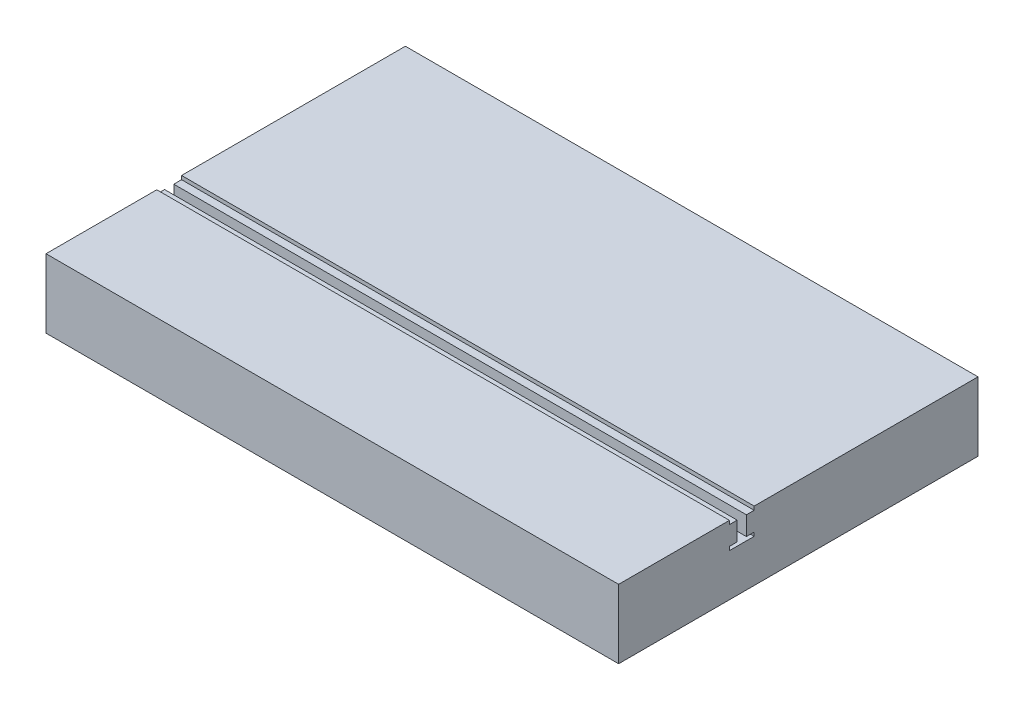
ISO-10303-21;
HEADER;
FILE_DESCRIPTION(('STEP AP214'),'2;1');
FILE_NAME('part.step','',(''),(''),'','','');
FILE_SCHEMA(('AUTOMOTIVE_DESIGN { 1 0 10303 214 1 1 1 1 }'));
ENDSEC;
DATA;
#1=APPLICATION_CONTEXT('core data for automotive mechanical design processes');
#2=APPLICATION_PROTOCOL_DEFINITION('international standard','automotive_design',2000,#1);
#3=PRODUCT_CONTEXT('',#1,'mechanical');
#4=PRODUCT('Part','Part','',(#3));
#5=PRODUCT_RELATED_PRODUCT_CATEGORY('part','',(#4));
#6=PRODUCT_DEFINITION_FORMATION('','',#4);
#7=PRODUCT_DEFINITION_CONTEXT('part definition',#1,'design');
#8=PRODUCT_DEFINITION('design','',#6,#7);
#9=PRODUCT_DEFINITION_SHAPE('','',#8);
#10=(LENGTH_UNIT() NAMED_UNIT(*) SI_UNIT(.MILLI.,.METRE.));
#11=(NAMED_UNIT(*) PLANE_ANGLE_UNIT() SI_UNIT($,.RADIAN.));
#12=(NAMED_UNIT(*) SI_UNIT($,.STERADIAN.) SOLID_ANGLE_UNIT());
#13=UNCERTAINTY_MEASURE_WITH_UNIT(LENGTH_MEASURE(1.E-05),#10,'distance_accuracy_value','');
#14=(GEOMETRIC_REPRESENTATION_CONTEXT(3) GLOBAL_UNCERTAINTY_ASSIGNED_CONTEXT((#13)) GLOBAL_UNIT_ASSIGNED_CONTEXT((#10,
#11,#12)) REPRESENTATION_CONTEXT('',''));
#15=CARTESIAN_POINT('',(0.,0.,0.));
#16=DIRECTION('',(0.,0.,1.));
#17=DIRECTION('',(1.,0.,0.));
#18=AXIS2_PLACEMENT_3D('',#15,#16,#17);
#19=CARTESIAN_POINT('',(-99.8579162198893,24.,62.6713484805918));
#20=DIRECTION('',(0.,1.,0.));
#21=DIRECTION('',(0.,0.,1.));
#22=AXIS2_PLACEMENT_3D('',#19,#20,#21);
#23=PLANE('',#22);
#24=DIRECTION('',(1.,0.,0.));
#25=VECTOR('',#24,1.);
#26=CARTESIAN_POINT('',(-99.8579162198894,24.,15.3894813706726));
#27=LINE('',#26,#25);
#28=CARTESIAN_POINT('',(-99.8579162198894,24.,15.3894813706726));
#29=VERTEX_POINT('',#28);
#30=CARTESIAN_POINT('',(99.8579162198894,24.,15.3894813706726));
#31=VERTEX_POINT('',#30);
#32=EDGE_CURVE('E150',#29,#31,#27,.T.);
#33=ORIENTED_EDGE('',*,*,#32,.T.);
#34=DIRECTION('',(0.,0.,-1.));
#35=VECTOR('',#34,1.);
#36=CARTESIAN_POINT('',(99.8579162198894,24.,-62.6713484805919));
#37=LINE('',#36,#35);
#38=CARTESIAN_POINT('',(99.8579162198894,24.,-62.6713484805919));
#39=VERTEX_POINT('',#38);
#40=EDGE_CURVE('E172',#31,#39,#37,.T.);
#41=ORIENTED_EDGE('',*,*,#40,.T.);
#42=DIRECTION('',(-1.,0.,0.));
#43=VECTOR('',#42,1.);
#44=CARTESIAN_POINT('',(-99.8579162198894,24.,-62.6713484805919));
#45=LINE('',#44,#43);
#46=CARTESIAN_POINT('',(-99.8579162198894,24.,-62.6713484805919));
#47=VERTEX_POINT('',#46);
#48=EDGE_CURVE('E59',#39,#47,#45,.T.);
#49=ORIENTED_EDGE('',*,*,#48,.T.);
#50=DIRECTION('',(0.,0.,1.));
#51=VECTOR('',#50,1.);
#52=CARTESIAN_POINT('',(-99.8579162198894,24.,-62.6713484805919));
#53=LINE('',#52,#51);
#54=EDGE_CURVE('E164',#47,#29,#53,.T.);
#55=ORIENTED_EDGE('',*,*,#54,.T.);
#56=EDGE_LOOP('',(#33,#41,#49,#55));
#57=FACE_BOUND('',#56,.T.);
#58=ADVANCED_FACE('F36',(#57),#23,.T.);
#59=CARTESIAN_POINT('',(-99.8579162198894,24.,-62.6713484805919));
#60=DIRECTION('',(1.,0.,0.));
#61=DIRECTION('',(0.,0.,-1.));
#62=AXIS2_PLACEMENT_3D('',#59,#60,#61);
#63=PLANE('',#62);
#64=DIRECTION('',(0.,0.,-1.));
#65=VECTOR('',#64,1.);
#66=CARTESIAN_POINT('',(-99.8579162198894,22.714983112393,15.3894813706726));
#67=LINE('',#66,#65);
#68=CARTESIAN_POINT('',(-99.8579162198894,22.714983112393,18.0972982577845));
#69=VERTEX_POINT('',#68);
#70=CARTESIAN_POINT('',(-99.8579162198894,22.714983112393,15.3894813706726));
#71=VERTEX_POINT('',#70);
#72=EDGE_CURVE('E159',#69,#71,#67,.T.);
#73=ORIENTED_EDGE('',*,*,#72,.T.);
#74=DIRECTION('',(0.,1.,0.));
#75=VECTOR('',#74,1.);
#76=CARTESIAN_POINT('',(-99.8579162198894,24.,15.3894813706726));
#77=LINE('',#76,#75);
#78=EDGE_CURVE('E153',#71,#29,#77,.T.);
#79=ORIENTED_EDGE('',*,*,#78,.T.);
#80=ORIENTED_EDGE('',*,*,#54,.F.);
#81=DIRECTION('',(0.,-1.,0.));
#82=VECTOR('',#81,1.);
#83=CARTESIAN_POINT('',(-99.8579162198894,24.,-62.6713484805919));
#84=LINE('',#83,#82);
#85=CARTESIAN_POINT('',(-99.8579162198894,0.,-62.6713484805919));
#86=VERTEX_POINT('',#85);
#87=EDGE_CURVE('E182',#47,#86,#84,.T.);
#88=ORIENTED_EDGE('',*,*,#87,.T.);
#89=DIRECTION('',(0.,0.,1.));
#90=VECTOR('',#89,1.);
#91=CARTESIAN_POINT('',(-99.8579162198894,0.,-62.6713484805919));
#92=LINE('',#91,#90);
#93=CARTESIAN_POINT('',(-99.8579162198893,0.,62.6713484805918));
#94=VERTEX_POINT('',#93);
#95=EDGE_CURVE('E202',#86,#94,#92,.T.);
#96=ORIENTED_EDGE('',*,*,#95,.T.);
#97=DIRECTION('',(0.,-1.,0.));
#98=VECTOR('',#97,1.);
#99=CARTESIAN_POINT('',(-99.8579162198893,24.,62.6713484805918));
#100=LINE('',#99,#98);
#101=CARTESIAN_POINT('',(-99.8579162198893,24.,62.6713484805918));
#102=VERTEX_POINT('',#101);
#103=EDGE_CURVE('E11',#102,#94,#100,.T.);
#104=ORIENTED_EDGE('',*,*,#103,.F.);
#105=CARTESIAN_POINT('',(-99.8579162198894,24.,24.0335741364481));
#106=VERTEX_POINT('',#105);
#107=EDGE_CURVE('E170',#106,#102,#53,.T.);
#108=ORIENTED_EDGE('',*,*,#107,.F.);
#109=DIRECTION('',(0.,-1.,0.));
#110=VECTOR('',#109,1.);
#111=CARTESIAN_POINT('',(-99.8579162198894,24.,24.0335741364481));
#112=LINE('',#111,#110);
#113=CARTESIAN_POINT('',(-99.8579162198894,22.714983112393,24.0335741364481));
#114=VERTEX_POINT('',#113);
#115=EDGE_CURVE('E51',#106,#114,#112,.T.);
#116=ORIENTED_EDGE('',*,*,#115,.T.);
#117=DIRECTION('',(0.,0.,-1.));
#118=VECTOR('',#117,1.);
#119=CARTESIAN_POINT('',(-99.8579162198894,22.714983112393,24.0335741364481));
#120=LINE('',#119,#118);
#121=CARTESIAN_POINT('',(-99.8579162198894,22.714983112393,21.3257572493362));
#122=VERTEX_POINT('',#121);
#123=EDGE_CURVE('E279',#114,#122,#120,.T.);
#124=ORIENTED_EDGE('',*,*,#123,.T.);
#125=DIRECTION('',(0.,-1.,0.));
#126=VECTOR('',#125,1.);
#127=CARTESIAN_POINT('',(-99.8579162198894,22.714983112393,21.3257572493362));
#128=LINE('',#127,#126);
#129=CARTESIAN_POINT('',(-99.8579162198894,16.1307105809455,21.3257572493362));
#130=VERTEX_POINT('',#129);
#131=EDGE_CURVE('E276',#122,#130,#128,.T.);
#132=ORIENTED_EDGE('',*,*,#131,.T.);
#133=DIRECTION('',(0.,0.,1.));
#134=VECTOR('',#133,1.);
#135=CARTESIAN_POINT('',(-99.8579162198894,16.1307105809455,21.3257572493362));
#136=LINE('',#135,#134);
#137=CARTESIAN_POINT('',(-99.8579162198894,16.1307105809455,24.0335741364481));
#138=VERTEX_POINT('',#137);
#139=EDGE_CURVE('E273',#130,#138,#136,.T.);
#140=ORIENTED_EDGE('',*,*,#139,.T.);
#141=DIRECTION('',(0.,-1.,0.));
#142=VECTOR('',#141,1.);
#143=CARTESIAN_POINT('',(-99.8579162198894,16.1307105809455,24.0335741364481));
#144=LINE('',#143,#142);
#145=CARTESIAN_POINT('',(-99.8579162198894,14.8456936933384,24.0335741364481));
#146=VERTEX_POINT('',#145);
#147=EDGE_CURVE('E270',#138,#146,#144,.T.);
#148=ORIENTED_EDGE('',*,*,#147,.T.);
#149=DIRECTION('',(0.,0.,-1.));
#150=VECTOR('',#149,1.);
#151=CARTESIAN_POINT('',(-99.8579162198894,14.8456936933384,15.3894813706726));
#152=LINE('',#151,#150);
#153=CARTESIAN_POINT('',(-99.8579162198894,14.8456936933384,15.3894813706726));
#154=VERTEX_POINT('',#153);
#155=EDGE_CURVE('E267',#146,#154,#152,.T.);
#156=ORIENTED_EDGE('',*,*,#155,.T.);
#157=DIRECTION('',(0.,1.,0.));
#158=VECTOR('',#157,1.);
#159=CARTESIAN_POINT('',(-99.8579162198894,16.1307105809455,15.3894813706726));
#160=LINE('',#159,#158);
#161=CARTESIAN_POINT('',(-99.8579162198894,16.1307105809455,15.3894813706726));
#162=VERTEX_POINT('',#161);
#163=EDGE_CURVE('E264',#154,#162,#160,.T.);
#164=ORIENTED_EDGE('',*,*,#163,.T.);
#165=DIRECTION('',(0.,0.,1.));
#166=VECTOR('',#165,1.);
#167=CARTESIAN_POINT('',(-99.8579162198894,16.1307105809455,18.0972982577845));
#168=LINE('',#167,#166);
#169=CARTESIAN_POINT('',(-99.8579162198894,16.1307105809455,18.0972982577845));
#170=VERTEX_POINT('',#169);
#171=EDGE_CURVE('E261',#162,#170,#168,.T.);
#172=ORIENTED_EDGE('',*,*,#171,.T.);
#173=DIRECTION('',(0.,1.,0.));
#174=VECTOR('',#173,1.);
#175=CARTESIAN_POINT('',(-99.8579162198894,22.714983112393,18.0972982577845));
#176=LINE('',#175,#174);
#177=EDGE_CURVE('E259',#170,#69,#176,.T.);
#178=ORIENTED_EDGE('',*,*,#177,.T.);
#179=EDGE_LOOP('',(#73,#79,#80,#88,#96,#104,#108,#116,#124,#132,#140,#148,#156,#164,#172,#178));
#180=FACE_BOUND('',#179,.T.);
#181=ADVANCED_FACE('F38',(#180),#63,.F.);
#182=CARTESIAN_POINT('',(-99.8579162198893,24.,62.6713484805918));
#183=DIRECTION('',(0.,0.,-1.));
#184=DIRECTION('',(-1.,0.,0.));
#185=AXIS2_PLACEMENT_3D('',#182,#183,#184);
#186=PLANE('',#185);
#187=DIRECTION('',(1.,0.,0.));
#188=VECTOR('',#187,1.);
#189=CARTESIAN_POINT('',(-99.8579162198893,0.,62.6713484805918));
#190=LINE('',#189,#188);
#191=CARTESIAN_POINT('',(99.8579162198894,0.,62.6713484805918));
#192=VERTEX_POINT('',#191);
#193=EDGE_CURVE('E201',#94,#192,#190,.T.);
#194=ORIENTED_EDGE('',*,*,#193,.T.);
#195=DIRECTION('',(0.,-1.,0.));
#196=VECTOR('',#195,1.);
#197=CARTESIAN_POINT('',(99.8579162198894,24.,62.6713484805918));
#198=LINE('',#197,#196);
#199=CARTESIAN_POINT('',(99.8579162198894,24.,62.6713484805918));
#200=VERTEX_POINT('',#199);
#201=EDGE_CURVE('E44',#200,#192,#198,.T.);
#202=ORIENTED_EDGE('',*,*,#201,.F.);
#203=DIRECTION('',(1.,0.,0.));
#204=VECTOR('',#203,1.);
#205=CARTESIAN_POINT('',(-99.8579162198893,24.,62.6713484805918));
#206=LINE('',#205,#204);
#207=EDGE_CURVE('E169',#102,#200,#206,.T.);
#208=ORIENTED_EDGE('',*,*,#207,.F.);
#209=ORIENTED_EDGE('',*,*,#103,.T.);
#210=EDGE_LOOP('',(#194,#202,#208,#209));
#211=FACE_BOUND('',#210,.T.);
#212=ADVANCED_FACE('F287',(#211),#186,.F.);
#213=CARTESIAN_POINT('',(99.8579162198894,24.,-62.6713484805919));
#214=DIRECTION('',(-1.,0.,0.));
#215=DIRECTION('',(0.,0.,1.));
#216=AXIS2_PLACEMENT_3D('',#213,#214,#215);
#217=PLANE('',#216);
#218=ORIENTED_EDGE('',*,*,#40,.F.);
#219=DIRECTION('',(0.,1.,0.));
#220=VECTOR('',#219,1.);
#221=CARTESIAN_POINT('',(99.8579162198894,24.,15.3894813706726));
#222=LINE('',#221,#220);
#223=CARTESIAN_POINT('',(99.8579162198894,22.714983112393,15.3894813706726));
#224=VERTEX_POINT('',#223);
#225=EDGE_CURVE('E156',#224,#31,#222,.T.);
#226=ORIENTED_EDGE('',*,*,#225,.F.);
#227=DIRECTION('',(0.,0.,-1.));
#228=VECTOR('',#227,1.);
#229=CARTESIAN_POINT('',(99.8579162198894,22.714983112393,15.3894813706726));
#230=LINE('',#229,#228);
#231=CARTESIAN_POINT('',(99.8579162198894,22.714983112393,18.0972982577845));
#232=VERTEX_POINT('',#231);
#233=EDGE_CURVE('E167',#232,#224,#230,.T.);
#234=ORIENTED_EDGE('',*,*,#233,.F.);
#235=DIRECTION('',(0.,1.,0.));
#236=VECTOR('',#235,1.);
#237=CARTESIAN_POINT('',(99.8579162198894,22.714983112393,18.0972982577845));
#238=LINE('',#237,#236);
#239=CARTESIAN_POINT('',(99.8579162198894,16.1307105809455,18.0972982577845));
#240=VERTEX_POINT('',#239);
#241=EDGE_CURVE('E230',#240,#232,#238,.T.);
#242=ORIENTED_EDGE('',*,*,#241,.F.);
#243=DIRECTION('',(0.,0.,1.));
#244=VECTOR('',#243,1.);
#245=CARTESIAN_POINT('',(99.8579162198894,16.1307105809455,18.0972982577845));
#246=LINE('',#245,#244);
#247=CARTESIAN_POINT('',(99.8579162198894,16.1307105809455,15.3894813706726));
#248=VERTEX_POINT('',#247);
#249=EDGE_CURVE('E233',#248,#240,#246,.T.);
#250=ORIENTED_EDGE('',*,*,#249,.F.);
#251=DIRECTION('',(0.,1.,0.));
#252=VECTOR('',#251,1.);
#253=CARTESIAN_POINT('',(99.8579162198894,16.1307105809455,15.3894813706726));
#254=LINE('',#253,#252);
#255=CARTESIAN_POINT('',(99.8579162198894,14.8456936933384,15.3894813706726));
#256=VERTEX_POINT('',#255);
#257=EDGE_CURVE('E236',#256,#248,#254,.T.);
#258=ORIENTED_EDGE('',*,*,#257,.F.);
#259=DIRECTION('',(0.,0.,-1.));
#260=VECTOR('',#259,1.);
#261=CARTESIAN_POINT('',(99.8579162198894,14.8456936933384,15.3894813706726));
#262=LINE('',#261,#260);
#263=CARTESIAN_POINT('',(99.8579162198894,14.8456936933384,24.0335741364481));
#264=VERTEX_POINT('',#263);
#265=EDGE_CURVE('E239',#264,#256,#262,.T.);
#266=ORIENTED_EDGE('',*,*,#265,.F.);
#267=DIRECTION('',(0.,-1.,0.));
#268=VECTOR('',#267,1.);
#269=CARTESIAN_POINT('',(99.8579162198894,16.1307105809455,24.0335741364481));
#270=LINE('',#269,#268);
#271=CARTESIAN_POINT('',(99.8579162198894,16.1307105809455,24.0335741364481));
#272=VERTEX_POINT('',#271);
#273=EDGE_CURVE('E242',#272,#264,#270,.T.);
#274=ORIENTED_EDGE('',*,*,#273,.F.);
#275=DIRECTION('',(0.,0.,1.));
#276=VECTOR('',#275,1.);
#277=CARTESIAN_POINT('',(99.8579162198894,16.1307105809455,21.3257572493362));
#278=LINE('',#277,#276);
#279=CARTESIAN_POINT('',(99.8579162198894,16.1307105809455,21.3257572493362));
#280=VERTEX_POINT('',#279);
#281=EDGE_CURVE('E245',#280,#272,#278,.T.);
#282=ORIENTED_EDGE('',*,*,#281,.F.);
#283=DIRECTION('',(0.,-1.,0.));
#284=VECTOR('',#283,1.);
#285=CARTESIAN_POINT('',(99.8579162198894,22.714983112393,21.3257572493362));
#286=LINE('',#285,#284);
#287=CARTESIAN_POINT('',(99.8579162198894,22.714983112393,21.3257572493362));
#288=VERTEX_POINT('',#287);
#289=EDGE_CURVE('E248',#288,#280,#286,.T.);
#290=ORIENTED_EDGE('',*,*,#289,.F.);
#291=DIRECTION('',(0.,0.,-1.));
#292=VECTOR('',#291,1.);
#293=CARTESIAN_POINT('',(99.8579162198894,22.714983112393,24.0335741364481));
#294=LINE('',#293,#292);
#295=CARTESIAN_POINT('',(99.8579162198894,22.714983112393,24.0335741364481));
#296=VERTEX_POINT('',#295);
#297=EDGE_CURVE('E251',#296,#288,#294,.T.);
#298=ORIENTED_EDGE('',*,*,#297,.F.);
#299=DIRECTION('',(0.,-1.,0.));
#300=VECTOR('',#299,1.);
#301=CARTESIAN_POINT('',(99.8579162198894,24.,24.0335741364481));
#302=LINE('',#301,#300);
#303=CARTESIAN_POINT('',(99.8579162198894,24.,24.0335741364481));
#304=VERTEX_POINT('',#303);
#305=EDGE_CURVE('E254',#304,#296,#302,.T.);
#306=ORIENTED_EDGE('',*,*,#305,.F.);
#307=EDGE_CURVE('E178',#200,#304,#37,.T.);
#308=ORIENTED_EDGE('',*,*,#307,.F.);
#309=ORIENTED_EDGE('',*,*,#201,.T.);
#310=DIRECTION('',(0.,0.,-1.));
#311=VECTOR('',#310,1.);
#312=CARTESIAN_POINT('',(99.8579162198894,0.,-62.6713484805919));
#313=LINE('',#312,#311);
#314=CARTESIAN_POINT('',(99.8579162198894,0.,-62.6713484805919));
#315=VERTEX_POINT('',#314);
#316=EDGE_CURVE('E193',#192,#315,#313,.T.);
#317=ORIENTED_EDGE('',*,*,#316,.T.);
#318=DIRECTION('',(0.,-1.,0.));
#319=VECTOR('',#318,1.);
#320=CARTESIAN_POINT('',(99.8579162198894,24.,-62.6713484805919));
#321=LINE('',#320,#319);
#322=EDGE_CURVE('E184',#39,#315,#321,.T.);
#323=ORIENTED_EDGE('',*,*,#322,.F.);
#324=EDGE_LOOP('',(#218,#226,#234,#242,#250,#258,#266,#274,#282,#290,#298,#306,#308,#309,#317,#323));
#325=FACE_BOUND('',#324,.T.);
#326=ADVANCED_FACE('F191',(#325),#217,.F.);
#327=CARTESIAN_POINT('',(-99.8579162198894,24.,-62.6713484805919));
#328=DIRECTION('',(0.,0.,1.));
#329=DIRECTION('',(1.,0.,0.));
#330=AXIS2_PLACEMENT_3D('',#327,#328,#329);
#331=PLANE('',#330);
#332=DIRECTION('',(-1.,0.,0.));
#333=VECTOR('',#332,1.);
#334=CARTESIAN_POINT('',(-99.8579162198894,0.,-62.6713484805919));
#335=LINE('',#334,#333);
#336=EDGE_CURVE('E174',#315,#86,#335,.T.);
#337=ORIENTED_EDGE('',*,*,#336,.T.);
#338=ORIENTED_EDGE('',*,*,#87,.F.);
#339=ORIENTED_EDGE('',*,*,#48,.F.);
#340=ORIENTED_EDGE('',*,*,#322,.T.);
#341=EDGE_LOOP('',(#337,#338,#339,#340));
#342=FACE_BOUND('',#341,.T.);
#343=ADVANCED_FACE('F289',(#342),#331,.F.);
#344=DIRECTION('',(1.,0.,0.));
#345=VECTOR('',#344,1.);
#346=CARTESIAN_POINT('',(-99.8579162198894,24.,24.0335741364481));
#347=LINE('',#346,#345);
#348=EDGE_CURVE('E158',#106,#304,#347,.T.);
#349=ORIENTED_EDGE('',*,*,#348,.F.);
#350=ORIENTED_EDGE('',*,*,#107,.T.);
#351=ORIENTED_EDGE('',*,*,#207,.T.);
#352=ORIENTED_EDGE('',*,*,#307,.T.);
#353=EDGE_LOOP('',(#349,#350,#351,#352));
#354=FACE_BOUND('',#353,.T.);
#355=ADVANCED_FACE('F286',(#354),#23,.T.);
#356=CARTESIAN_POINT('',(-99.8579162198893,0.,62.6713484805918));
#357=DIRECTION('',(0.,1.,0.));
#358=DIRECTION('',(0.,0.,1.));
#359=AXIS2_PLACEMENT_3D('',#356,#357,#358);
#360=PLANE('',#359);
#361=ORIENTED_EDGE('',*,*,#95,.F.);
#362=ORIENTED_EDGE('',*,*,#336,.F.);
#363=ORIENTED_EDGE('',*,*,#316,.F.);
#364=ORIENTED_EDGE('',*,*,#193,.F.);
#365=EDGE_LOOP('',(#361,#362,#363,#364));
#366=FACE_BOUND('',#365,.T.);
#367=ADVANCED_FACE('F200',(#366),#360,.F.);
#368=CARTESIAN_POINT('',(-99.8579162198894,24.,15.3894813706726));
#369=DIRECTION('',(0.,0.,-1.));
#370=DIRECTION('',(-1.,0.,0.));
#371=AXIS2_PLACEMENT_3D('',#368,#369,#370);
#372=PLANE('',#371);
#373=ORIENTED_EDGE('',*,*,#225,.T.);
#374=ORIENTED_EDGE('',*,*,#32,.F.);
#375=ORIENTED_EDGE('',*,*,#78,.F.);
#376=DIRECTION('',(1.,0.,0.));
#377=VECTOR('',#376,1.);
#378=CARTESIAN_POINT('',(-99.8579162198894,22.714983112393,15.3894813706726));
#379=LINE('',#378,#377);
#380=EDGE_CURVE('E206',#71,#224,#379,.T.);
#381=ORIENTED_EDGE('',*,*,#380,.T.);
#382=EDGE_LOOP('',(#373,#374,#375,#381));
#383=FACE_BOUND('',#382,.T.);
#384=ADVANCED_FACE('F152',(#383),#372,.F.);
#385=CARTESIAN_POINT('',(-99.8579162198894,22.714983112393,15.3894813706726));
#386=DIRECTION('',(0.,-1.,0.));
#387=DIRECTION('',(0.,0.,-1.));
#388=AXIS2_PLACEMENT_3D('',#385,#386,#387);
#389=PLANE('',#388);
#390=ORIENTED_EDGE('',*,*,#233,.T.);
#391=ORIENTED_EDGE('',*,*,#380,.F.);
#392=ORIENTED_EDGE('',*,*,#72,.F.);
#393=DIRECTION('',(1.,0.,0.));
#394=VECTOR('',#393,1.);
#395=CARTESIAN_POINT('',(-99.8579162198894,22.714983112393,18.0972982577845));
#396=LINE('',#395,#394);
#397=EDGE_CURVE('E225',#69,#232,#396,.T.);
#398=ORIENTED_EDGE('',*,*,#397,.T.);
#399=EDGE_LOOP('',(#390,#391,#392,#398));
#400=FACE_BOUND('',#399,.T.);
#401=ADVANCED_FACE('F294',(#400),#389,.F.);
#402=CARTESIAN_POINT('',(-99.8579162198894,22.714983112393,18.0972982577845));
#403=DIRECTION('',(0.,0.,-1.));
#404=DIRECTION('',(-1.,0.,0.));
#405=AXIS2_PLACEMENT_3D('',#402,#403,#404);
#406=PLANE('',#405);
#407=ORIENTED_EDGE('',*,*,#241,.T.);
#408=ORIENTED_EDGE('',*,*,#397,.F.);
#409=ORIENTED_EDGE('',*,*,#177,.F.);
#410=DIRECTION('',(1.,0.,0.));
#411=VECTOR('',#410,1.);
#412=CARTESIAN_POINT('',(-99.8579162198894,16.1307105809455,18.0972982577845));
#413=LINE('',#412,#411);
#414=EDGE_CURVE('E223',#170,#240,#413,.T.);
#415=ORIENTED_EDGE('',*,*,#414,.T.);
#416=EDGE_LOOP('',(#407,#408,#409,#415));
#417=FACE_BOUND('',#416,.T.);
#418=ADVANCED_FACE('F297',(#417),#406,.F.);
#419=CARTESIAN_POINT('',(-99.8579162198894,16.1307105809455,18.0972982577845));
#420=DIRECTION('',(0.,1.,0.));
#421=DIRECTION('',(0.,0.,1.));
#422=AXIS2_PLACEMENT_3D('',#419,#420,#421);
#423=PLANE('',#422);
#424=ORIENTED_EDGE('',*,*,#249,.T.);
#425=ORIENTED_EDGE('',*,*,#414,.F.);
#426=ORIENTED_EDGE('',*,*,#171,.F.);
#427=DIRECTION('',(1.,0.,0.));
#428=VECTOR('',#427,1.);
#429=CARTESIAN_POINT('',(-99.8579162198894,16.1307105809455,15.3894813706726));
#430=LINE('',#429,#428);
#431=EDGE_CURVE('E221',#162,#248,#430,.T.);
#432=ORIENTED_EDGE('',*,*,#431,.T.);
#433=EDGE_LOOP('',(#424,#425,#426,#432));
#434=FACE_BOUND('',#433,.T.);
#435=ADVANCED_FACE('F300',(#434),#423,.F.);
#436=CARTESIAN_POINT('',(-99.8579162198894,16.1307105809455,15.3894813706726));
#437=DIRECTION('',(0.,0.,-1.));
#438=DIRECTION('',(-1.,0.,0.));
#439=AXIS2_PLACEMENT_3D('',#436,#437,#438);
#440=PLANE('',#439);
#441=ORIENTED_EDGE('',*,*,#257,.T.);
#442=ORIENTED_EDGE('',*,*,#431,.F.);
#443=ORIENTED_EDGE('',*,*,#163,.F.);
#444=DIRECTION('',(1.,0.,0.));
#445=VECTOR('',#444,1.);
#446=CARTESIAN_POINT('',(-99.8579162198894,14.8456936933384,15.3894813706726));
#447=LINE('',#446,#445);
#448=EDGE_CURVE('E219',#154,#256,#447,.T.);
#449=ORIENTED_EDGE('',*,*,#448,.T.);
#450=EDGE_LOOP('',(#441,#442,#443,#449));
#451=FACE_BOUND('',#450,.T.);
#452=ADVANCED_FACE('F305',(#451),#440,.F.);
#453=CARTESIAN_POINT('',(-99.8579162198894,14.8456936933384,15.3894813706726));
#454=DIRECTION('',(0.,-1.,0.));
#455=DIRECTION('',(0.,0.,-1.));
#456=AXIS2_PLACEMENT_3D('',#453,#454,#455);
#457=PLANE('',#456);
#458=ORIENTED_EDGE('',*,*,#265,.T.);
#459=ORIENTED_EDGE('',*,*,#448,.F.);
#460=ORIENTED_EDGE('',*,*,#155,.F.);
#461=DIRECTION('',(1.,0.,0.));
#462=VECTOR('',#461,1.);
#463=CARTESIAN_POINT('',(-99.8579162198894,14.8456936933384,24.0335741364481));
#464=LINE('',#463,#462);
#465=EDGE_CURVE('E217',#146,#264,#464,.T.);
#466=ORIENTED_EDGE('',*,*,#465,.T.);
#467=EDGE_LOOP('',(#458,#459,#460,#466));
#468=FACE_BOUND('',#467,.T.);
#469=ADVANCED_FACE('F309',(#468),#457,.F.);
#470=CARTESIAN_POINT('',(-99.8579162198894,16.1307105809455,24.0335741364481));
#471=DIRECTION('',(0.,0.,1.));
#472=DIRECTION('',(1.,0.,0.));
#473=AXIS2_PLACEMENT_3D('',#470,#471,#472);
#474=PLANE('',#473);
#475=ORIENTED_EDGE('',*,*,#273,.T.);
#476=ORIENTED_EDGE('',*,*,#465,.F.);
#477=ORIENTED_EDGE('',*,*,#147,.F.);
#478=DIRECTION('',(1.,0.,0.));
#479=VECTOR('',#478,1.);
#480=CARTESIAN_POINT('',(-99.8579162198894,16.1307105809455,24.0335741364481));
#481=LINE('',#480,#479);
#482=EDGE_CURVE('E215',#138,#272,#481,.T.);
#483=ORIENTED_EDGE('',*,*,#482,.T.);
#484=EDGE_LOOP('',(#475,#476,#477,#483));
#485=FACE_BOUND('',#484,.T.);
#486=ADVANCED_FACE('F312',(#485),#474,.F.);
#487=CARTESIAN_POINT('',(-99.8579162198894,16.1307105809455,21.3257572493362));
#488=DIRECTION('',(0.,1.,0.));
#489=DIRECTION('',(0.,0.,1.));
#490=AXIS2_PLACEMENT_3D('',#487,#488,#489);
#491=PLANE('',#490);
#492=ORIENTED_EDGE('',*,*,#281,.T.);
#493=ORIENTED_EDGE('',*,*,#482,.F.);
#494=ORIENTED_EDGE('',*,*,#139,.F.);
#495=DIRECTION('',(1.,0.,0.));
#496=VECTOR('',#495,1.);
#497=CARTESIAN_POINT('',(-99.8579162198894,16.1307105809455,21.3257572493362));
#498=LINE('',#497,#496);
#499=EDGE_CURVE('E213',#130,#280,#498,.T.);
#500=ORIENTED_EDGE('',*,*,#499,.T.);
#501=EDGE_LOOP('',(#492,#493,#494,#500));
#502=FACE_BOUND('',#501,.T.);
#503=ADVANCED_FACE('F317',(#502),#491,.F.);
#504=CARTESIAN_POINT('',(-99.8579162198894,22.714983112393,21.3257572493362));
#505=DIRECTION('',(0.,0.,1.));
#506=DIRECTION('',(1.,0.,0.));
#507=AXIS2_PLACEMENT_3D('',#504,#505,#506);
#508=PLANE('',#507);
#509=ORIENTED_EDGE('',*,*,#289,.T.);
#510=ORIENTED_EDGE('',*,*,#499,.F.);
#511=ORIENTED_EDGE('',*,*,#131,.F.);
#512=DIRECTION('',(1.,0.,0.));
#513=VECTOR('',#512,1.);
#514=CARTESIAN_POINT('',(-99.8579162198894,22.714983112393,21.3257572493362));
#515=LINE('',#514,#513);
#516=EDGE_CURVE('E211',#122,#288,#515,.T.);
#517=ORIENTED_EDGE('',*,*,#516,.T.);
#518=EDGE_LOOP('',(#509,#510,#511,#517));
#519=FACE_BOUND('',#518,.T.);
#520=ADVANCED_FACE('F321',(#519),#508,.F.);
#521=CARTESIAN_POINT('',(-99.8579162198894,22.714983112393,24.0335741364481));
#522=DIRECTION('',(0.,-1.,0.));
#523=DIRECTION('',(0.,0.,-1.));
#524=AXIS2_PLACEMENT_3D('',#521,#522,#523);
#525=PLANE('',#524);
#526=ORIENTED_EDGE('',*,*,#297,.T.);
#527=ORIENTED_EDGE('',*,*,#516,.F.);
#528=ORIENTED_EDGE('',*,*,#123,.F.);
#529=DIRECTION('',(1.,0.,0.));
#530=VECTOR('',#529,1.);
#531=CARTESIAN_POINT('',(-99.8579162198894,22.714983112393,24.0335741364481));
#532=LINE('',#531,#530);
#533=EDGE_CURVE('E209',#114,#296,#532,.T.);
#534=ORIENTED_EDGE('',*,*,#533,.T.);
#535=EDGE_LOOP('',(#526,#527,#528,#534));
#536=FACE_BOUND('',#535,.T.);
#537=ADVANCED_FACE('F323',(#536),#525,.F.);
#538=CARTESIAN_POINT('',(-99.8579162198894,24.,24.0335741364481));
#539=DIRECTION('',(0.,0.,1.));
#540=DIRECTION('',(1.,0.,0.));
#541=AXIS2_PLACEMENT_3D('',#538,#539,#540);
#542=PLANE('',#541);
#543=ORIENTED_EDGE('',*,*,#305,.T.);
#544=ORIENTED_EDGE('',*,*,#533,.F.);
#545=ORIENTED_EDGE('',*,*,#115,.F.);
#546=ORIENTED_EDGE('',*,*,#348,.T.);
#547=EDGE_LOOP('',(#543,#544,#545,#546));
#548=FACE_BOUND('',#547,.T.);
#549=ADVANCED_FACE('F324',(#548),#542,.F.);
#550=CLOSED_SHELL('',(#58,#181,#212,#326,#343,#355,#367,#384,#401,#418,#435,#452,#469,#486,#503,
#520,#537,#549));
#551=MANIFOLD_SOLID_BREP('B2',#550);
#552=ADVANCED_BREP_SHAPE_REPRESENTATION('',(#18,#551),#14);
#553=SHAPE_DEFINITION_REPRESENTATION(#9,#552);
ENDSEC;
END-ISO-10303-21;
